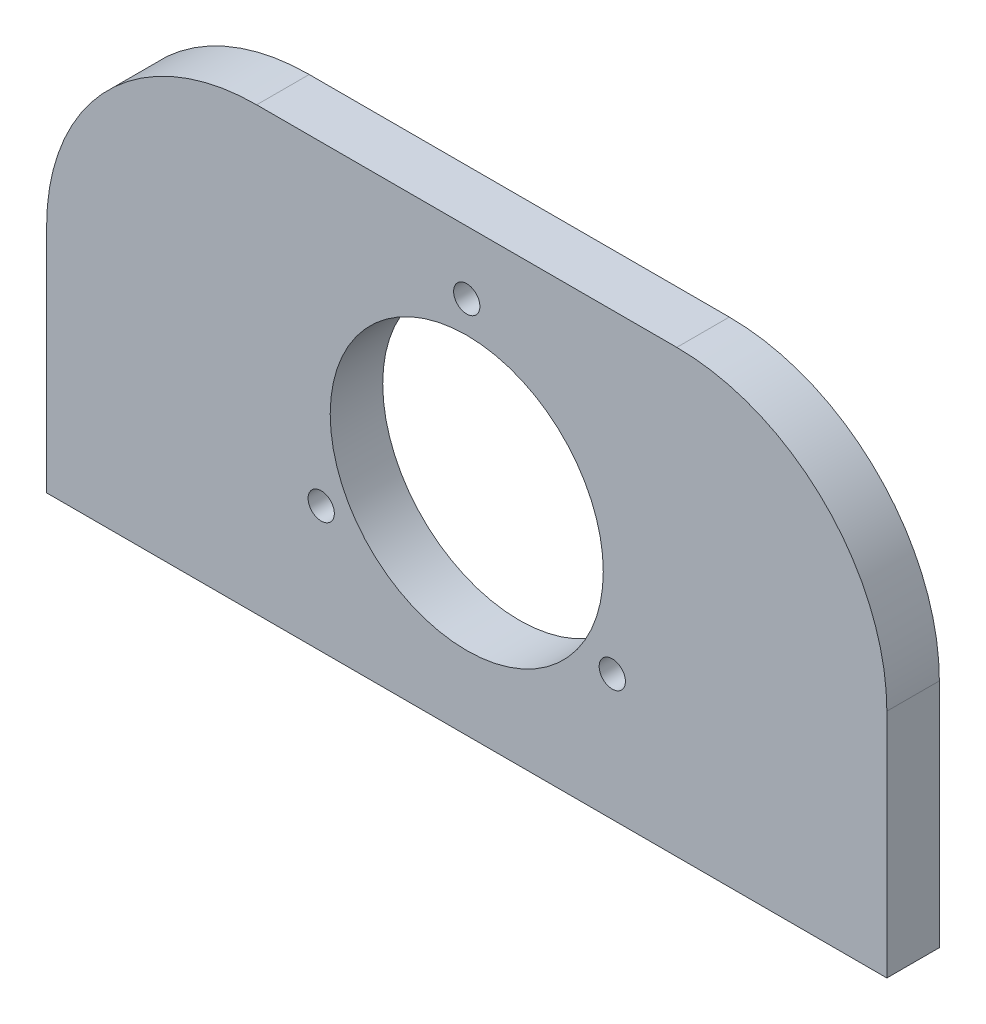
from build123d import *

# Parameters (mm, degrees)
ESQUISSE1_W                       = 80
ESQUISSE1_H                       = 42
ESQUISSE1_R                       = 13
BOSS_EXTRU_1_DEPTH                = 2.5
CONG_1_R                          = 20
DIAM_TRE_DU_PER_AGE_4_0_4_1_D     = 4
DIAM_TRE_DU_PER_AGE_4_0_4_1_DEPTH = 4
DIAM_TRE_DU_PER_AGE_4_0_4_1_TIP   = 1.201721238
TROU_TARAUD_M41_D                 = 3.3
TROU_TARAUD_M41_DEPTH             = 11.5
TROU_TARAUD_M41_TIP               = 0.991420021
TROU_TARAUD_M31_D                 = 2.5


with BuildPart() as part:
    # Esquisse1 → Boss.-Extru.1 (new, symmetric)
    with BuildSketch(Plane.XY):
        with Locations((0, 1)):
            Rectangle(ESQUISSE1_W, ESQUISSE1_H)
        Circle(ESQUISSE1_R, mode=Mode.SUBTRACT)
    extrude(amount=BOSS_EXTRU_1_DEPTH, both=True)

    # Cong_1
    cong_1_edges = [part.edges().sort_by_distance(p)[0] for p in [
        (-40, 22, 0),
        (40, 22, 0),
    ]]
    fillet(cong_1_edges, radius=CONG_1_R)

    # Diam_tre du per_age _4.0 _4_1
    with Locations(Plane(origin=(0, -20, 0), x_dir=(-1, 0, 0), z_dir=(0, -1, 0))):
        with Locations((-20, 0), (20, 0)):
            Hole(DIAM_TRE_DU_PER_AGE_4_0_4_1_D / 2, depth=DIAM_TRE_DU_PER_AGE_4_0_4_1_DEPTH)
            with Locations((0, 0, -(DIAM_TRE_DU_PER_AGE_4_0_4_1_DEPTH + DIAM_TRE_DU_PER_AGE_4_0_4_1_TIP / 2))):  # 118° drill point
                Cone(0, DIAM_TRE_DU_PER_AGE_4_0_4_1_D / 2, DIAM_TRE_DU_PER_AGE_4_0_4_1_TIP, mode=Mode.SUBTRACT)

    # Trou taraud_ M41
    with Locations(Plane(origin=(0, -20, 0), x_dir=(-1, 0, 0), z_dir=(0, -1, 0))):
        with Locations((-33.5, 0), (33.5, 0)):
            Hole(TROU_TARAUD_M41_D / 2, depth=TROU_TARAUD_M41_DEPTH)
            with Locations((0, 0, -(TROU_TARAUD_M41_DEPTH + TROU_TARAUD_M41_TIP / 2))):  # 118° drill point
                Cone(0, TROU_TARAUD_M41_D / 2, TROU_TARAUD_M41_TIP, mode=Mode.SUBTRACT)

    # Trou taraud_ M31 (through all)
    with Locations(Plane.XY.offset(2.5)):
        with Locations((13.856406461, -8), (0, 16), (-13.856406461, -8)):
            Hole(TROU_TARAUD_M31_D / 2)


solid = part.part
